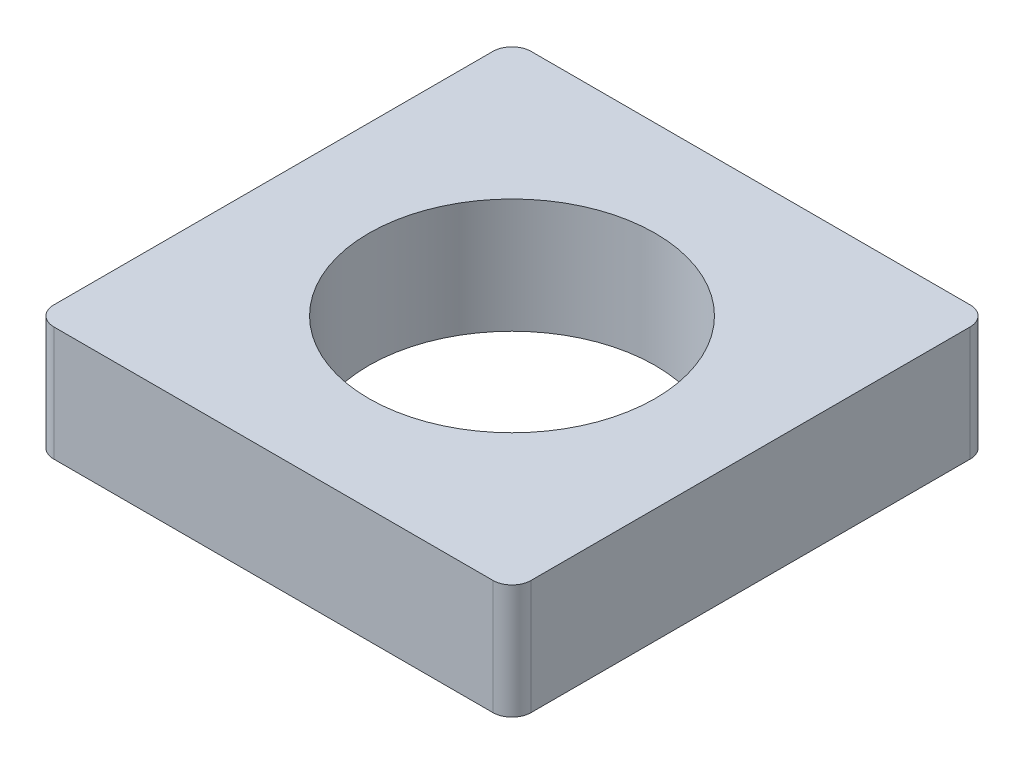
from build123d import *

# Parameters (mm, degrees)
SKETCH1_R           = 38.1
BOSS_EXTRUDE1_DEPTH = 30.48
SKETCH2_R           = 2.286
CUT_EXTRUDE1_DEPTH  = 10.16


with BuildPart() as part:
    # Sketch1 → Boss-Extrude1 (new body)
    with BuildSketch(Plane(origin=(0, 0, 0), x_dir=(1, 0, 0), z_dir=(0, 1, 0))):
        with BuildLine():
            Line((58.42, -63.5), (-58.42, -63.5))
            ThreePointArc((-58.42, -63.5), (-62.012102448, -62.012102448), (-63.5, -58.42))
            Line((-63.5, -58.42), (-63.5, 58.42))
            ThreePointArc((-63.5, 58.42), (-62.012102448, 62.012102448), (-58.42, 63.5))
            Line((-58.42, 63.5), (58.42, 63.5))
            ThreePointArc((58.42, 63.5), (62.012102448, 62.012102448), (63.5, 58.42))
            Line((63.5, 58.42), (63.5, -58.42))
            ThreePointArc((63.5, -58.42), (62.012102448, -62.012102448), (58.42, -63.5))
        make_face()
        with Locations(Location((0, 0, 0), (0, 0, 90))):
            Circle(SKETCH1_R, mode=Mode.SUBTRACT)
    extrude(amount=BOSS_EXTRUDE1_DEPTH)

    # Sketch2 → Cut-Extrude1 (cut)
    with BuildSketch(Plane.XZ):
        with Locations(Location((41.91, 0, 0), (0, 0, 270))):
            Circle(SKETCH2_R)
    extrude(amount=-CUT_EXTRUDE1_DEPTH, mode=Mode.SUBTRACT)


solid = part.part
